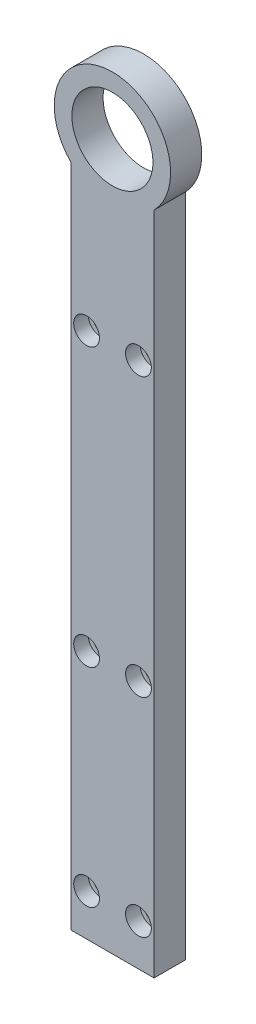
ISO-10303-21;
HEADER;
FILE_DESCRIPTION(('STEP AP214'),'2;1');
FILE_NAME('part.step','',(''),(''),'','','');
FILE_SCHEMA(('AUTOMOTIVE_DESIGN { 1 0 10303 214 1 1 1 1 }'));
ENDSEC;
DATA;
#1=APPLICATION_CONTEXT('core data for automotive mechanical design processes');
#2=APPLICATION_PROTOCOL_DEFINITION('international standard','automotive_design',2000,#1);
#3=PRODUCT_CONTEXT('',#1,'mechanical');
#4=PRODUCT('Part','Part','',(#3));
#5=PRODUCT_RELATED_PRODUCT_CATEGORY('part','',(#4));
#6=PRODUCT_DEFINITION_FORMATION('','',#4);
#7=PRODUCT_DEFINITION_CONTEXT('part definition',#1,'design');
#8=PRODUCT_DEFINITION('design','',#6,#7);
#9=PRODUCT_DEFINITION_SHAPE('','',#8);
#10=(LENGTH_UNIT() NAMED_UNIT(*) SI_UNIT(.MILLI.,.METRE.));
#11=(NAMED_UNIT(*) PLANE_ANGLE_UNIT() SI_UNIT($,.RADIAN.));
#12=(NAMED_UNIT(*) SI_UNIT($,.STERADIAN.) SOLID_ANGLE_UNIT());
#13=UNCERTAINTY_MEASURE_WITH_UNIT(LENGTH_MEASURE(1.E-05),#10,'distance_accuracy_value','');
#14=(GEOMETRIC_REPRESENTATION_CONTEXT(3) GLOBAL_UNCERTAINTY_ASSIGNED_CONTEXT((#13)) GLOBAL_UNIT_ASSIGNED_CONTEXT((#10,
#11,#12)) REPRESENTATION_CONTEXT('',''));
#15=CARTESIAN_POINT('',(0.,0.,0.));
#16=DIRECTION('',(0.,0.,1.));
#17=DIRECTION('',(1.,0.,0.));
#18=AXIS2_PLACEMENT_3D('',#15,#16,#17);
#19=CARTESIAN_POINT('',(-7.89318467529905,-202.911058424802,9.525));
#20=DIRECTION('',(0.,0.,-1.));
#21=DIRECTION('',(-1.,0.,0.));
#22=AXIS2_PLACEMENT_3D('',#19,#20,#21);
#23=CYLINDRICAL_SURFACE('',#22,2.4765);
#24=CARTESIAN_POINT('',(-7.89318467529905,-202.911058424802,0.));
#25=DIRECTION('',(0.,0.,1.));
#26=DIRECTION('',(1.,0.,0.));
#27=AXIS2_PLACEMENT_3D('',#24,#25,#26);
#28=CIRCLE('',#27,2.4765);
#29=CARTESIAN_POINT('',(-10.3696846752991,-202.911058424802,0.));
#30=VERTEX_POINT('',#29);
#31=EDGE_CURVE('E151',#30,#30,#28,.T.);
#32=CARTESIAN_POINT('',(-7.89318467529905,-202.911058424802,5.08));
#33=DIRECTION('',(0.,0.,1.));
#34=DIRECTION('',(1.,0.,0.));
#35=AXIS2_PLACEMENT_3D('',#32,#33,#34);
#36=CIRCLE('',#35,2.4765);
#37=CARTESIAN_POINT('',(-10.3696846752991,-202.911058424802,5.08));
#38=VERTEX_POINT('',#37);
#39=EDGE_CURVE('E37',#38,#38,#36,.T.);
#40=CARTESIAN_POINT('',(-10.3696846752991,-202.911058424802,0.));
#41=CARTESIAN_POINT('',(-10.3696846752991,-202.911058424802,0.0529166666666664));
#42=CARTESIAN_POINT('',(-10.3696846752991,-202.911058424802,0.105833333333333));
#43=CARTESIAN_POINT('',(-10.3696846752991,-202.911058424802,0.211666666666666));
#44=CARTESIAN_POINT('',(-10.3696846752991,-202.911058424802,0.264583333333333));
#45=CARTESIAN_POINT('',(-10.3696846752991,-202.911058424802,0.370416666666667));
#46=CARTESIAN_POINT('',(-10.3696846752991,-202.911058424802,0.423333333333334));
#47=CARTESIAN_POINT('',(-10.3696846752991,-202.911058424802,0.529166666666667));
#48=CARTESIAN_POINT('',(-10.3696846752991,-202.911058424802,0.582083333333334));
#49=CARTESIAN_POINT('',(-10.3696846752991,-202.911058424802,0.687916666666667));
#50=CARTESIAN_POINT('',(-10.3696846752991,-202.911058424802,0.740833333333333));
#51=CARTESIAN_POINT('',(-10.3696846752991,-202.911058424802,0.846666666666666));
#52=CARTESIAN_POINT('',(-10.3696846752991,-202.911058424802,0.899583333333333));
#53=CARTESIAN_POINT('',(-10.3696846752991,-202.911058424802,1.00541666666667));
#54=CARTESIAN_POINT('',(-10.3696846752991,-202.911058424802,1.05833333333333));
#55=CARTESIAN_POINT('',(-10.3696846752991,-202.911058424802,1.16416666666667));
#56=CARTESIAN_POINT('',(-10.3696846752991,-202.911058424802,1.21708333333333));
#57=CARTESIAN_POINT('',(-10.3696846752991,-202.911058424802,1.32291666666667));
#58=CARTESIAN_POINT('',(-10.3696846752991,-202.911058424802,1.37583333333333));
#59=CARTESIAN_POINT('',(-10.3696846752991,-202.911058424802,1.48166666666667));
#60=CARTESIAN_POINT('',(-10.3696846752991,-202.911058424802,1.53458333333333));
#61=CARTESIAN_POINT('',(-10.3696846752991,-202.911058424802,1.64041666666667));
#62=CARTESIAN_POINT('',(-10.3696846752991,-202.911058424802,1.69333333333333));
#63=CARTESIAN_POINT('',(-10.3696846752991,-202.911058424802,1.79916666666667));
#64=CARTESIAN_POINT('',(-10.3696846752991,-202.911058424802,1.85208333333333));
#65=CARTESIAN_POINT('',(-10.3696846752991,-202.911058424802,1.95791666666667));
#66=CARTESIAN_POINT('',(-10.3696846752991,-202.911058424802,2.01083333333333));
#67=CARTESIAN_POINT('',(-10.3696846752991,-202.911058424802,2.11666666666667));
#68=CARTESIAN_POINT('',(-10.3696846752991,-202.911058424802,2.16958333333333));
#69=CARTESIAN_POINT('',(-10.3696846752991,-202.911058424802,2.27541666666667));
#70=CARTESIAN_POINT('',(-10.3696846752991,-202.911058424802,2.32833333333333));
#71=CARTESIAN_POINT('',(-10.3696846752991,-202.911058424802,2.43416666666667));
#72=CARTESIAN_POINT('',(-10.3696846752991,-202.911058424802,2.48708333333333));
#73=CARTESIAN_POINT('',(-10.3696846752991,-202.911058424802,2.59291666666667));
#74=CARTESIAN_POINT('',(-10.3696846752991,-202.911058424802,2.64583333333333));
#75=CARTESIAN_POINT('',(-10.3696846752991,-202.911058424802,2.75166666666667));
#76=CARTESIAN_POINT('',(-10.3696846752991,-202.911058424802,2.80458333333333));
#77=CARTESIAN_POINT('',(-10.3696846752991,-202.911058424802,2.91041666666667));
#78=CARTESIAN_POINT('',(-10.3696846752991,-202.911058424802,2.96333333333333));
#79=CARTESIAN_POINT('',(-10.3696846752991,-202.911058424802,3.06916666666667));
#80=CARTESIAN_POINT('',(-10.3696846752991,-202.911058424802,3.12208333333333));
#81=CARTESIAN_POINT('',(-10.3696846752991,-202.911058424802,3.22791666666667));
#82=CARTESIAN_POINT('',(-10.3696846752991,-202.911058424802,3.28083333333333));
#83=CARTESIAN_POINT('',(-10.3696846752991,-202.911058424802,3.38666666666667));
#84=CARTESIAN_POINT('',(-10.3696846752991,-202.911058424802,3.43958333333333));
#85=CARTESIAN_POINT('',(-10.3696846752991,-202.911058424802,3.54541666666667));
#86=CARTESIAN_POINT('',(-10.3696846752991,-202.911058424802,3.59833333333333));
#87=CARTESIAN_POINT('',(-10.3696846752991,-202.911058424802,3.70416666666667));
#88=CARTESIAN_POINT('',(-10.3696846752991,-202.911058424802,3.75708333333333));
#89=CARTESIAN_POINT('',(-10.3696846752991,-202.911058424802,3.86291666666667));
#90=CARTESIAN_POINT('',(-10.3696846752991,-202.911058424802,3.91583333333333));
#91=CARTESIAN_POINT('',(-10.3696846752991,-202.911058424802,4.02166666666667));
#92=CARTESIAN_POINT('',(-10.3696846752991,-202.911058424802,4.07458333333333));
#93=CARTESIAN_POINT('',(-10.3696846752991,-202.911058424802,4.18041666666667));
#94=CARTESIAN_POINT('',(-10.3696846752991,-202.911058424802,4.23333333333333));
#95=CARTESIAN_POINT('',(-10.3696846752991,-202.911058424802,4.33916666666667));
#96=CARTESIAN_POINT('',(-10.3696846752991,-202.911058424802,4.39208333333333));
#97=CARTESIAN_POINT('',(-10.3696846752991,-202.911058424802,4.49791666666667));
#98=CARTESIAN_POINT('',(-10.3696846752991,-202.911058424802,4.55083333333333));
#99=CARTESIAN_POINT('',(-10.3696846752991,-202.911058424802,4.65666666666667));
#100=CARTESIAN_POINT('',(-10.3696846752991,-202.911058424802,4.70958333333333));
#101=CARTESIAN_POINT('',(-10.3696846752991,-202.911058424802,4.81541666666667));
#102=CARTESIAN_POINT('',(-10.3696846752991,-202.911058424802,4.86833333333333));
#103=CARTESIAN_POINT('',(-10.3696846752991,-202.911058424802,4.97416666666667));
#104=CARTESIAN_POINT('',(-10.3696846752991,-202.911058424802,5.02708333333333));
#105=CARTESIAN_POINT('',(-10.3696846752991,-202.911058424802,5.08));
#106=B_SPLINE_CURVE_WITH_KNOTS('',3,(#40,#41,#42,#43,#44,#45,#46,#47,#48,#49,#50,#51,#52,#53,
#54,#55,#56,#57,#58,#59,#60,#61,#62,#63,#64,#65,#66,#67,#68,#69,#70,#71,#72,#73,#74,#75,#76,#77,
#78,#79,#80,#81,#82,#83,#84,#85,#86,#87,#88,#89,#90,#91,#92,#93,#94,#95,#96,#97,#98,#99,#100,
#101,#102,#103,#104,#105),.UNSPECIFIED.,.F.,.F.,(4,2,2,2,2,2,2,2,2,2,2,2,2,2,2,2,2,2,2,2,2,2,2,
2,2,2,2,2,2,2,2,2,4),(0.,0.158749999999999,0.3175,0.476250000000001,0.635,0.793749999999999,
0.9525,1.11125,1.27,1.42875,1.5875,1.74625,1.905,2.06375,2.2225,2.38125,2.54,2.69875,2.8575,
3.01625,3.175,3.33375,3.4925,3.65125,3.81,3.96875,4.1275,4.28625,4.445,4.60375,4.7625,4.92125,
5.08),.UNSPECIFIED.);
#107=EDGE_CURVE('BSEAM33',#30,#38,#106,.T.);
#108=ORIENTED_EDGE('',*,*,#31,.F.);
#109=ORIENTED_EDGE('',*,*,#39,.T.);
#110=ORIENTED_EDGE('',*,*,#107,.T.);
#111=ORIENTED_EDGE('',*,*,#107,.F.);
#112=EDGE_LOOP('',(#108,#110,#109,#111));
#113=FACE_BOUND('',#112,.T.);
#114=ADVANCED_FACE('F33',(#113),#23,.F.);
#115=CARTESIAN_POINT('',(7.95641532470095,-202.911058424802,9.525));
#116=DIRECTION('',(0.,0.,-1.));
#117=DIRECTION('',(-1.,0.,0.));
#118=AXIS2_PLACEMENT_3D('',#115,#116,#117);
#119=CYLINDRICAL_SURFACE('',#118,2.4765);
#120=CARTESIAN_POINT('',(7.95641532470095,-202.911058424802,0.));
#121=DIRECTION('',(0.,0.,1.));
#122=DIRECTION('',(1.,0.,0.));
#123=AXIS2_PLACEMENT_3D('',#120,#121,#122);
#124=CIRCLE('',#123,2.4765);
#125=CARTESIAN_POINT('',(5.47991532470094,-202.911058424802,0.));
#126=VERTEX_POINT('',#125);
#127=EDGE_CURVE('E148',#126,#126,#124,.T.);
#128=CARTESIAN_POINT('',(7.95641532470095,-202.911058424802,5.08));
#129=DIRECTION('',(0.,0.,1.));
#130=DIRECTION('',(1.,0.,0.));
#131=AXIS2_PLACEMENT_3D('',#128,#129,#130);
#132=CIRCLE('',#131,2.4765);
#133=CARTESIAN_POINT('',(5.47991532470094,-202.911058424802,5.08));
#134=VERTEX_POINT('',#133);
#135=EDGE_CURVE('E124',#134,#134,#132,.T.);
#136=CARTESIAN_POINT('',(5.47991532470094,-202.911058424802,0.));
#137=CARTESIAN_POINT('',(5.47991532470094,-202.911058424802,0.0529166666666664));
#138=CARTESIAN_POINT('',(5.47991532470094,-202.911058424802,0.105833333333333));
#139=CARTESIAN_POINT('',(5.47991532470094,-202.911058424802,0.211666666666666));
#140=CARTESIAN_POINT('',(5.47991532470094,-202.911058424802,0.264583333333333));
#141=CARTESIAN_POINT('',(5.47991532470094,-202.911058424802,0.370416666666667));
#142=CARTESIAN_POINT('',(5.47991532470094,-202.911058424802,0.423333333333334));
#143=CARTESIAN_POINT('',(5.47991532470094,-202.911058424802,0.529166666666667));
#144=CARTESIAN_POINT('',(5.47991532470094,-202.911058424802,0.582083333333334));
#145=CARTESIAN_POINT('',(5.47991532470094,-202.911058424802,0.687916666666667));
#146=CARTESIAN_POINT('',(5.47991532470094,-202.911058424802,0.740833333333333));
#147=CARTESIAN_POINT('',(5.47991532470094,-202.911058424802,0.846666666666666));
#148=CARTESIAN_POINT('',(5.47991532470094,-202.911058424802,0.899583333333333));
#149=CARTESIAN_POINT('',(5.47991532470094,-202.911058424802,1.00541666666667));
#150=CARTESIAN_POINT('',(5.47991532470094,-202.911058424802,1.05833333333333));
#151=CARTESIAN_POINT('',(5.47991532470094,-202.911058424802,1.16416666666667));
#152=CARTESIAN_POINT('',(5.47991532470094,-202.911058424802,1.21708333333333));
#153=CARTESIAN_POINT('',(5.47991532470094,-202.911058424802,1.32291666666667));
#154=CARTESIAN_POINT('',(5.47991532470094,-202.911058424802,1.37583333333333));
#155=CARTESIAN_POINT('',(5.47991532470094,-202.911058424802,1.48166666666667));
#156=CARTESIAN_POINT('',(5.47991532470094,-202.911058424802,1.53458333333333));
#157=CARTESIAN_POINT('',(5.47991532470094,-202.911058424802,1.64041666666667));
#158=CARTESIAN_POINT('',(5.47991532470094,-202.911058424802,1.69333333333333));
#159=CARTESIAN_POINT('',(5.47991532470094,-202.911058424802,1.79916666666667));
#160=CARTESIAN_POINT('',(5.47991532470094,-202.911058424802,1.85208333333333));
#161=CARTESIAN_POINT('',(5.47991532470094,-202.911058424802,1.95791666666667));
#162=CARTESIAN_POINT('',(5.47991532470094,-202.911058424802,2.01083333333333));
#163=CARTESIAN_POINT('',(5.47991532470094,-202.911058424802,2.11666666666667));
#164=CARTESIAN_POINT('',(5.47991532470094,-202.911058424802,2.16958333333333));
#165=CARTESIAN_POINT('',(5.47991532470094,-202.911058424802,2.27541666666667));
#166=CARTESIAN_POINT('',(5.47991532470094,-202.911058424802,2.32833333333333));
#167=CARTESIAN_POINT('',(5.47991532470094,-202.911058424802,2.43416666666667));
#168=CARTESIAN_POINT('',(5.47991532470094,-202.911058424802,2.48708333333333));
#169=CARTESIAN_POINT('',(5.47991532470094,-202.911058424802,2.59291666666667));
#170=CARTESIAN_POINT('',(5.47991532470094,-202.911058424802,2.64583333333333));
#171=CARTESIAN_POINT('',(5.47991532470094,-202.911058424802,2.75166666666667));
#172=CARTESIAN_POINT('',(5.47991532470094,-202.911058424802,2.80458333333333));
#173=CARTESIAN_POINT('',(5.47991532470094,-202.911058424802,2.91041666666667));
#174=CARTESIAN_POINT('',(5.47991532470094,-202.911058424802,2.96333333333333));
#175=CARTESIAN_POINT('',(5.47991532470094,-202.911058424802,3.06916666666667));
#176=CARTESIAN_POINT('',(5.47991532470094,-202.911058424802,3.12208333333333));
#177=CARTESIAN_POINT('',(5.47991532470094,-202.911058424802,3.22791666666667));
#178=CARTESIAN_POINT('',(5.47991532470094,-202.911058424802,3.28083333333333));
#179=CARTESIAN_POINT('',(5.47991532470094,-202.911058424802,3.38666666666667));
#180=CARTESIAN_POINT('',(5.47991532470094,-202.911058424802,3.43958333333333));
#181=CARTESIAN_POINT('',(5.47991532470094,-202.911058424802,3.54541666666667));
#182=CARTESIAN_POINT('',(5.47991532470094,-202.911058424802,3.59833333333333));
#183=CARTESIAN_POINT('',(5.47991532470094,-202.911058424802,3.70416666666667));
#184=CARTESIAN_POINT('',(5.47991532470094,-202.911058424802,3.75708333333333));
#185=CARTESIAN_POINT('',(5.47991532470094,-202.911058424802,3.86291666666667));
#186=CARTESIAN_POINT('',(5.47991532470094,-202.911058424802,3.91583333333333));
#187=CARTESIAN_POINT('',(5.47991532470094,-202.911058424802,4.02166666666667));
#188=CARTESIAN_POINT('',(5.47991532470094,-202.911058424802,4.07458333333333));
#189=CARTESIAN_POINT('',(5.47991532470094,-202.911058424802,4.18041666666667));
#190=CARTESIAN_POINT('',(5.47991532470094,-202.911058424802,4.23333333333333));
#191=CARTESIAN_POINT('',(5.47991532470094,-202.911058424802,4.33916666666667));
#192=CARTESIAN_POINT('',(5.47991532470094,-202.911058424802,4.39208333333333));
#193=CARTESIAN_POINT('',(5.47991532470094,-202.911058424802,4.49791666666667));
#194=CARTESIAN_POINT('',(5.47991532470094,-202.911058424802,4.55083333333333));
#195=CARTESIAN_POINT('',(5.47991532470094,-202.911058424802,4.65666666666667));
#196=CARTESIAN_POINT('',(5.47991532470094,-202.911058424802,4.70958333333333));
#197=CARTESIAN_POINT('',(5.47991532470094,-202.911058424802,4.81541666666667));
#198=CARTESIAN_POINT('',(5.47991532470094,-202.911058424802,4.86833333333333));
#199=CARTESIAN_POINT('',(5.47991532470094,-202.911058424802,4.97416666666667));
#200=CARTESIAN_POINT('',(5.47991532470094,-202.911058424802,5.02708333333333));
#201=CARTESIAN_POINT('',(5.47991532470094,-202.911058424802,5.08));
#202=B_SPLINE_CURVE_WITH_KNOTS('',3,(#136,#137,#138,#139,#140,#141,#142,#143,#144,#145,#146,
#147,#148,#149,#150,#151,#152,#153,#154,#155,#156,#157,#158,#159,#160,#161,#162,#163,#164,#165,
#166,#167,#168,#169,#170,#171,#172,#173,#174,#175,#176,#177,#178,#179,#180,#181,#182,#183,#184,
#185,#186,#187,#188,#189,#190,#191,#192,#193,#194,#195,#196,#197,#198,#199,#200,#201),
.UNSPECIFIED.,.F.,.F.,(4,2,2,2,2,2,2,2,2,2,2,2,2,2,2,2,2,2,2,2,2,2,2,2,2,2,2,2,2,2,2,2,4),(0.,
0.158749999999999,0.3175,0.476250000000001,0.635,0.793749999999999,0.9525,1.11125,1.27,1.42875,
1.5875,1.74625,1.905,2.06375,2.2225,2.38125,2.54,2.69875,2.8575,3.01625,3.175,3.33375,3.4925,
3.65125,3.81,3.96875,4.1275,4.28625,4.445,4.60375,4.7625,4.92125,5.08),.UNSPECIFIED.);
#203=EDGE_CURVE('BSEAM183',#126,#134,#202,.T.);
#204=ORIENTED_EDGE('',*,*,#127,.F.);
#205=ORIENTED_EDGE('',*,*,#135,.T.);
#206=ORIENTED_EDGE('',*,*,#203,.T.);
#207=ORIENTED_EDGE('',*,*,#203,.F.);
#208=EDGE_LOOP('',(#204,#206,#205,#207));
#209=FACE_BOUND('',#208,.T.);
#210=ADVANCED_FACE('F183',(#209),#119,.F.);
#211=CARTESIAN_POINT('',(7.95641532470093,-54.5496584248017,9.525));
#212=DIRECTION('',(0.,0.,-1.));
#213=DIRECTION('',(-1.,0.,0.));
#214=AXIS2_PLACEMENT_3D('',#211,#212,#213);
#215=CYLINDRICAL_SURFACE('',#214,2.4765);
#216=CARTESIAN_POINT('',(7.95641532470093,-54.5496584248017,0.));
#217=DIRECTION('',(0.,0.,1.));
#218=DIRECTION('',(1.,0.,0.));
#219=AXIS2_PLACEMENT_3D('',#216,#217,#218);
#220=CIRCLE('',#219,2.4765);
#221=CARTESIAN_POINT('',(5.47991532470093,-54.5496584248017,0.));
#222=VERTEX_POINT('',#221);
#223=EDGE_CURVE('E145',#222,#222,#220,.T.);
#224=CARTESIAN_POINT('',(7.95641532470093,-54.5496584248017,5.08));
#225=DIRECTION('',(0.,0.,1.));
#226=DIRECTION('',(1.,0.,0.));
#227=AXIS2_PLACEMENT_3D('',#224,#225,#226);
#228=CIRCLE('',#227,2.4765);
#229=CARTESIAN_POINT('',(5.47991532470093,-54.5496584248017,5.08));
#230=VERTEX_POINT('',#229);
#231=EDGE_CURVE('E122',#230,#230,#228,.T.);
#232=CARTESIAN_POINT('',(5.47991532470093,-54.5496584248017,0.));
#233=CARTESIAN_POINT('',(5.47991532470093,-54.5496584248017,0.0529166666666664));
#234=CARTESIAN_POINT('',(5.47991532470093,-54.5496584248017,0.105833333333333));
#235=CARTESIAN_POINT('',(5.47991532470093,-54.5496584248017,0.211666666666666));
#236=CARTESIAN_POINT('',(5.47991532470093,-54.5496584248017,0.264583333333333));
#237=CARTESIAN_POINT('',(5.47991532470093,-54.5496584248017,0.370416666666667));
#238=CARTESIAN_POINT('',(5.47991532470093,-54.5496584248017,0.423333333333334));
#239=CARTESIAN_POINT('',(5.47991532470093,-54.5496584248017,0.529166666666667));
#240=CARTESIAN_POINT('',(5.47991532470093,-54.5496584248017,0.582083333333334));
#241=CARTESIAN_POINT('',(5.47991532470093,-54.5496584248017,0.687916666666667));
#242=CARTESIAN_POINT('',(5.47991532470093,-54.5496584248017,0.740833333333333));
#243=CARTESIAN_POINT('',(5.47991532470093,-54.5496584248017,0.846666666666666));
#244=CARTESIAN_POINT('',(5.47991532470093,-54.5496584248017,0.899583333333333));
#245=CARTESIAN_POINT('',(5.47991532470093,-54.5496584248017,1.00541666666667));
#246=CARTESIAN_POINT('',(5.47991532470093,-54.5496584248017,1.05833333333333));
#247=CARTESIAN_POINT('',(5.47991532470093,-54.5496584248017,1.16416666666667));
#248=CARTESIAN_POINT('',(5.47991532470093,-54.5496584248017,1.21708333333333));
#249=CARTESIAN_POINT('',(5.47991532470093,-54.5496584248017,1.32291666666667));
#250=CARTESIAN_POINT('',(5.47991532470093,-54.5496584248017,1.37583333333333));
#251=CARTESIAN_POINT('',(5.47991532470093,-54.5496584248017,1.48166666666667));
#252=CARTESIAN_POINT('',(5.47991532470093,-54.5496584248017,1.53458333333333));
#253=CARTESIAN_POINT('',(5.47991532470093,-54.5496584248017,1.64041666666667));
#254=CARTESIAN_POINT('',(5.47991532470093,-54.5496584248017,1.69333333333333));
#255=CARTESIAN_POINT('',(5.47991532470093,-54.5496584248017,1.79916666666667));
#256=CARTESIAN_POINT('',(5.47991532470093,-54.5496584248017,1.85208333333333));
#257=CARTESIAN_POINT('',(5.47991532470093,-54.5496584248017,1.95791666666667));
#258=CARTESIAN_POINT('',(5.47991532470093,-54.5496584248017,2.01083333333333));
#259=CARTESIAN_POINT('',(5.47991532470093,-54.5496584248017,2.11666666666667));
#260=CARTESIAN_POINT('',(5.47991532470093,-54.5496584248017,2.16958333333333));
#261=CARTESIAN_POINT('',(5.47991532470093,-54.5496584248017,2.27541666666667));
#262=CARTESIAN_POINT('',(5.47991532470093,-54.5496584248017,2.32833333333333));
#263=CARTESIAN_POINT('',(5.47991532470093,-54.5496584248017,2.43416666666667));
#264=CARTESIAN_POINT('',(5.47991532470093,-54.5496584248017,2.48708333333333));
#265=CARTESIAN_POINT('',(5.47991532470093,-54.5496584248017,2.59291666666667));
#266=CARTESIAN_POINT('',(5.47991532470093,-54.5496584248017,2.64583333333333));
#267=CARTESIAN_POINT('',(5.47991532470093,-54.5496584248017,2.75166666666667));
#268=CARTESIAN_POINT('',(5.47991532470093,-54.5496584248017,2.80458333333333));
#269=CARTESIAN_POINT('',(5.47991532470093,-54.5496584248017,2.91041666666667));
#270=CARTESIAN_POINT('',(5.47991532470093,-54.5496584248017,2.96333333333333));
#271=CARTESIAN_POINT('',(5.47991532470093,-54.5496584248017,3.06916666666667));
#272=CARTESIAN_POINT('',(5.47991532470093,-54.5496584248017,3.12208333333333));
#273=CARTESIAN_POINT('',(5.47991532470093,-54.5496584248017,3.22791666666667));
#274=CARTESIAN_POINT('',(5.47991532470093,-54.5496584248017,3.28083333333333));
#275=CARTESIAN_POINT('',(5.47991532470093,-54.5496584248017,3.38666666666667));
#276=CARTESIAN_POINT('',(5.47991532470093,-54.5496584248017,3.43958333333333));
#277=CARTESIAN_POINT('',(5.47991532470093,-54.5496584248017,3.54541666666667));
#278=CARTESIAN_POINT('',(5.47991532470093,-54.5496584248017,3.59833333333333));
#279=CARTESIAN_POINT('',(5.47991532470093,-54.5496584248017,3.70416666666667));
#280=CARTESIAN_POINT('',(5.47991532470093,-54.5496584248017,3.75708333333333));
#281=CARTESIAN_POINT('',(5.47991532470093,-54.5496584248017,3.86291666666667));
#282=CARTESIAN_POINT('',(5.47991532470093,-54.5496584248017,3.91583333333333));
#283=CARTESIAN_POINT('',(5.47991532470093,-54.5496584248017,4.02166666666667));
#284=CARTESIAN_POINT('',(5.47991532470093,-54.5496584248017,4.07458333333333));
#285=CARTESIAN_POINT('',(5.47991532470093,-54.5496584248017,4.18041666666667));
#286=CARTESIAN_POINT('',(5.47991532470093,-54.5496584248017,4.23333333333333));
#287=CARTESIAN_POINT('',(5.47991532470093,-54.5496584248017,4.33916666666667));
#288=CARTESIAN_POINT('',(5.47991532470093,-54.5496584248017,4.39208333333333));
#289=CARTESIAN_POINT('',(5.47991532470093,-54.5496584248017,4.49791666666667));
#290=CARTESIAN_POINT('',(5.47991532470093,-54.5496584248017,4.55083333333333));
#291=CARTESIAN_POINT('',(5.47991532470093,-54.5496584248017,4.65666666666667));
#292=CARTESIAN_POINT('',(5.47991532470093,-54.5496584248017,4.70958333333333));
#293=CARTESIAN_POINT('',(5.47991532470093,-54.5496584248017,4.81541666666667));
#294=CARTESIAN_POINT('',(5.47991532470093,-54.5496584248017,4.86833333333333));
#295=CARTESIAN_POINT('',(5.47991532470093,-54.5496584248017,4.97416666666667));
#296=CARTESIAN_POINT('',(5.47991532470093,-54.5496584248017,5.02708333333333));
#297=CARTESIAN_POINT('',(5.47991532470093,-54.5496584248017,5.08));
#298=B_SPLINE_CURVE_WITH_KNOTS('',3,(#232,#233,#234,#235,#236,#237,#238,#239,#240,#241,#242,
#243,#244,#245,#246,#247,#248,#249,#250,#251,#252,#253,#254,#255,#256,#257,#258,#259,#260,#261,
#262,#263,#264,#265,#266,#267,#268,#269,#270,#271,#272,#273,#274,#275,#276,#277,#278,#279,#280,
#281,#282,#283,#284,#285,#286,#287,#288,#289,#290,#291,#292,#293,#294,#295,#296,#297),
.UNSPECIFIED.,.F.,.F.,(4,2,2,2,2,2,2,2,2,2,2,2,2,2,2,2,2,2,2,2,2,2,2,2,2,2,2,2,2,2,2,2,4),(0.,
0.158749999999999,0.3175,0.476250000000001,0.635,0.793749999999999,0.9525,1.11125,1.27,1.42875,
1.5875,1.74625,1.905,2.06375,2.2225,2.38125,2.54,2.69875,2.8575,3.01625,3.175,3.33375,3.4925,
3.65125,3.81,3.96875,4.1275,4.28625,4.445,4.60375,4.7625,4.92125,5.08),.UNSPECIFIED.);
#299=EDGE_CURVE('BSEAM189',#222,#230,#298,.T.);
#300=ORIENTED_EDGE('',*,*,#223,.F.);
#301=ORIENTED_EDGE('',*,*,#231,.T.);
#302=ORIENTED_EDGE('',*,*,#299,.T.);
#303=ORIENTED_EDGE('',*,*,#299,.F.);
#304=EDGE_LOOP('',(#300,#302,#301,#303));
#305=FACE_BOUND('',#304,.T.);
#306=ADVANCED_FACE('F189',(#305),#215,.F.);
#307=CARTESIAN_POINT('',(-7.89318467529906,-139.411058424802,9.525));
#308=DIRECTION('',(0.,0.,-1.));
#309=DIRECTION('',(-1.,0.,0.));
#310=AXIS2_PLACEMENT_3D('',#307,#308,#309);
#311=CYLINDRICAL_SURFACE('',#310,2.47650000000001);
#312=CARTESIAN_POINT('',(-7.89318467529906,-139.411058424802,0.));
#313=DIRECTION('',(0.,0.,1.));
#314=DIRECTION('',(1.,0.,0.));
#315=AXIS2_PLACEMENT_3D('',#312,#313,#314);
#316=CIRCLE('',#315,2.47650000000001);
#317=CARTESIAN_POINT('',(-10.3696846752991,-139.411058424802,0.));
#318=VERTEX_POINT('',#317);
#319=EDGE_CURVE('E142',#318,#318,#316,.T.);
#320=CARTESIAN_POINT('',(-7.89318467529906,-139.411058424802,5.08));
#321=DIRECTION('',(0.,0.,1.));
#322=DIRECTION('',(1.,0.,0.));
#323=AXIS2_PLACEMENT_3D('',#320,#321,#322);
#324=CIRCLE('',#323,2.47650000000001);
#325=CARTESIAN_POINT('',(-10.3696846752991,-139.411058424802,5.08));
#326=VERTEX_POINT('',#325);
#327=EDGE_CURVE('E118',#326,#326,#324,.T.);
#328=CARTESIAN_POINT('',(-10.3696846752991,-139.411058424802,0.));
#329=CARTESIAN_POINT('',(-10.3696846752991,-139.411058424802,0.0529166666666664));
#330=CARTESIAN_POINT('',(-10.3696846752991,-139.411058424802,0.105833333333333));
#331=CARTESIAN_POINT('',(-10.3696846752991,-139.411058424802,0.211666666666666));
#332=CARTESIAN_POINT('',(-10.3696846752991,-139.411058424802,0.264583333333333));
#333=CARTESIAN_POINT('',(-10.3696846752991,-139.411058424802,0.370416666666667));
#334=CARTESIAN_POINT('',(-10.3696846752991,-139.411058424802,0.423333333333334));
#335=CARTESIAN_POINT('',(-10.3696846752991,-139.411058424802,0.529166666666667));
#336=CARTESIAN_POINT('',(-10.3696846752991,-139.411058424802,0.582083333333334));
#337=CARTESIAN_POINT('',(-10.3696846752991,-139.411058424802,0.687916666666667));
#338=CARTESIAN_POINT('',(-10.3696846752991,-139.411058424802,0.740833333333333));
#339=CARTESIAN_POINT('',(-10.3696846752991,-139.411058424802,0.846666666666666));
#340=CARTESIAN_POINT('',(-10.3696846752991,-139.411058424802,0.899583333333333));
#341=CARTESIAN_POINT('',(-10.3696846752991,-139.411058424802,1.00541666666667));
#342=CARTESIAN_POINT('',(-10.3696846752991,-139.411058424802,1.05833333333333));
#343=CARTESIAN_POINT('',(-10.3696846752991,-139.411058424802,1.16416666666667));
#344=CARTESIAN_POINT('',(-10.3696846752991,-139.411058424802,1.21708333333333));
#345=CARTESIAN_POINT('',(-10.3696846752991,-139.411058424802,1.32291666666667));
#346=CARTESIAN_POINT('',(-10.3696846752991,-139.411058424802,1.37583333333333));
#347=CARTESIAN_POINT('',(-10.3696846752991,-139.411058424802,1.48166666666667));
#348=CARTESIAN_POINT('',(-10.3696846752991,-139.411058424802,1.53458333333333));
#349=CARTESIAN_POINT('',(-10.3696846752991,-139.411058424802,1.64041666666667));
#350=CARTESIAN_POINT('',(-10.3696846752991,-139.411058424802,1.69333333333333));
#351=CARTESIAN_POINT('',(-10.3696846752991,-139.411058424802,1.79916666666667));
#352=CARTESIAN_POINT('',(-10.3696846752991,-139.411058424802,1.85208333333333));
#353=CARTESIAN_POINT('',(-10.3696846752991,-139.411058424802,1.95791666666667));
#354=CARTESIAN_POINT('',(-10.3696846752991,-139.411058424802,2.01083333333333));
#355=CARTESIAN_POINT('',(-10.3696846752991,-139.411058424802,2.11666666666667));
#356=CARTESIAN_POINT('',(-10.3696846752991,-139.411058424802,2.16958333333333));
#357=CARTESIAN_POINT('',(-10.3696846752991,-139.411058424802,2.27541666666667));
#358=CARTESIAN_POINT('',(-10.3696846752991,-139.411058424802,2.32833333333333));
#359=CARTESIAN_POINT('',(-10.3696846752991,-139.411058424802,2.43416666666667));
#360=CARTESIAN_POINT('',(-10.3696846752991,-139.411058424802,2.48708333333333));
#361=CARTESIAN_POINT('',(-10.3696846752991,-139.411058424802,2.59291666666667));
#362=CARTESIAN_POINT('',(-10.3696846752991,-139.411058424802,2.64583333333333));
#363=CARTESIAN_POINT('',(-10.3696846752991,-139.411058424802,2.75166666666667));
#364=CARTESIAN_POINT('',(-10.3696846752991,-139.411058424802,2.80458333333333));
#365=CARTESIAN_POINT('',(-10.3696846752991,-139.411058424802,2.91041666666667));
#366=CARTESIAN_POINT('',(-10.3696846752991,-139.411058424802,2.96333333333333));
#367=CARTESIAN_POINT('',(-10.3696846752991,-139.411058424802,3.06916666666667));
#368=CARTESIAN_POINT('',(-10.3696846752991,-139.411058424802,3.12208333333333));
#369=CARTESIAN_POINT('',(-10.3696846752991,-139.411058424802,3.22791666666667));
#370=CARTESIAN_POINT('',(-10.3696846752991,-139.411058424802,3.28083333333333));
#371=CARTESIAN_POINT('',(-10.3696846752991,-139.411058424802,3.38666666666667));
#372=CARTESIAN_POINT('',(-10.3696846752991,-139.411058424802,3.43958333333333));
#373=CARTESIAN_POINT('',(-10.3696846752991,-139.411058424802,3.54541666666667));
#374=CARTESIAN_POINT('',(-10.3696846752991,-139.411058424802,3.59833333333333));
#375=CARTESIAN_POINT('',(-10.3696846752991,-139.411058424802,3.70416666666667));
#376=CARTESIAN_POINT('',(-10.3696846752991,-139.411058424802,3.75708333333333));
#377=CARTESIAN_POINT('',(-10.3696846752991,-139.411058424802,3.86291666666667));
#378=CARTESIAN_POINT('',(-10.3696846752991,-139.411058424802,3.91583333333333));
#379=CARTESIAN_POINT('',(-10.3696846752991,-139.411058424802,4.02166666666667));
#380=CARTESIAN_POINT('',(-10.3696846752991,-139.411058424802,4.07458333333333));
#381=CARTESIAN_POINT('',(-10.3696846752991,-139.411058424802,4.18041666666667));
#382=CARTESIAN_POINT('',(-10.3696846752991,-139.411058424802,4.23333333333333));
#383=CARTESIAN_POINT('',(-10.3696846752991,-139.411058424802,4.33916666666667));
#384=CARTESIAN_POINT('',(-10.3696846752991,-139.411058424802,4.39208333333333));
#385=CARTESIAN_POINT('',(-10.3696846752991,-139.411058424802,4.49791666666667));
#386=CARTESIAN_POINT('',(-10.3696846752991,-139.411058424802,4.55083333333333));
#387=CARTESIAN_POINT('',(-10.3696846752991,-139.411058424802,4.65666666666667));
#388=CARTESIAN_POINT('',(-10.3696846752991,-139.411058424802,4.70958333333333));
#389=CARTESIAN_POINT('',(-10.3696846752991,-139.411058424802,4.81541666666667));
#390=CARTESIAN_POINT('',(-10.3696846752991,-139.411058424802,4.86833333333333));
#391=CARTESIAN_POINT('',(-10.3696846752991,-139.411058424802,4.97416666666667));
#392=CARTESIAN_POINT('',(-10.3696846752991,-139.411058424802,5.02708333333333));
#393=CARTESIAN_POINT('',(-10.3696846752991,-139.411058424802,5.08));
#394=B_SPLINE_CURVE_WITH_KNOTS('',3,(#328,#329,#330,#331,#332,#333,#334,#335,#336,#337,#338,
#339,#340,#341,#342,#343,#344,#345,#346,#347,#348,#349,#350,#351,#352,#353,#354,#355,#356,#357,
#358,#359,#360,#361,#362,#363,#364,#365,#366,#367,#368,#369,#370,#371,#372,#373,#374,#375,#376,
#377,#378,#379,#380,#381,#382,#383,#384,#385,#386,#387,#388,#389,#390,#391,#392,#393),
.UNSPECIFIED.,.F.,.F.,(4,2,2,2,2,2,2,2,2,2,2,2,2,2,2,2,2,2,2,2,2,2,2,2,2,2,2,2,2,2,2,2,4),(0.,
0.158749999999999,0.3175,0.476250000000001,0.635,0.793749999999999,0.9525,1.11125,1.27,1.42875,
1.5875,1.74625,1.905,2.06375,2.2225,2.38125,2.54,2.69875,2.8575,3.01625,3.175,3.33375,3.4925,
3.65125,3.81,3.96875,4.1275,4.28625,4.445,4.60375,4.7625,4.92125,5.08),.UNSPECIFIED.);
#395=EDGE_CURVE('BSEAM203',#318,#326,#394,.T.);
#396=ORIENTED_EDGE('',*,*,#319,.F.);
#397=ORIENTED_EDGE('',*,*,#327,.T.);
#398=ORIENTED_EDGE('',*,*,#395,.T.);
#399=ORIENTED_EDGE('',*,*,#395,.F.);
#400=EDGE_LOOP('',(#396,#398,#397,#399));
#401=FACE_BOUND('',#400,.T.);
#402=ADVANCED_FACE('F203',(#401),#311,.F.);
#403=CARTESIAN_POINT('',(7.96911532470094,-139.411058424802,9.525));
#404=DIRECTION('',(0.,0.,-1.));
#405=DIRECTION('',(-1.,0.,0.));
#406=AXIS2_PLACEMENT_3D('',#403,#404,#405);
#407=CYLINDRICAL_SURFACE('',#406,2.47650000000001);
#408=CARTESIAN_POINT('',(7.96911532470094,-139.411058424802,0.));
#409=DIRECTION('',(0.,0.,1.));
#410=DIRECTION('',(1.,0.,0.));
#411=AXIS2_PLACEMENT_3D('',#408,#409,#410);
#412=CIRCLE('',#411,2.47650000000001);
#413=CARTESIAN_POINT('',(5.49261532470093,-139.411058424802,0.));
#414=VERTEX_POINT('',#413);
#415=EDGE_CURVE('E113',#414,#414,#412,.T.);
#416=CARTESIAN_POINT('',(7.96911532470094,-139.411058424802,5.08));
#417=DIRECTION('',(0.,0.,1.));
#418=DIRECTION('',(1.,0.,0.));
#419=AXIS2_PLACEMENT_3D('',#416,#417,#418);
#420=CIRCLE('',#419,2.47650000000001);
#421=CARTESIAN_POINT('',(5.49261532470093,-139.411058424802,5.08));
#422=VERTEX_POINT('',#421);
#423=EDGE_CURVE('E115',#422,#422,#420,.T.);
#424=CARTESIAN_POINT('',(5.49261532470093,-139.411058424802,0.));
#425=CARTESIAN_POINT('',(5.49261532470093,-139.411058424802,0.0529166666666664));
#426=CARTESIAN_POINT('',(5.49261532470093,-139.411058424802,0.105833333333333));
#427=CARTESIAN_POINT('',(5.49261532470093,-139.411058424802,0.211666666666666));
#428=CARTESIAN_POINT('',(5.49261532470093,-139.411058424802,0.264583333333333));
#429=CARTESIAN_POINT('',(5.49261532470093,-139.411058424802,0.370416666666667));
#430=CARTESIAN_POINT('',(5.49261532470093,-139.411058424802,0.423333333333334));
#431=CARTESIAN_POINT('',(5.49261532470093,-139.411058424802,0.529166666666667));
#432=CARTESIAN_POINT('',(5.49261532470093,-139.411058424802,0.582083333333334));
#433=CARTESIAN_POINT('',(5.49261532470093,-139.411058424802,0.687916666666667));
#434=CARTESIAN_POINT('',(5.49261532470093,-139.411058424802,0.740833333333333));
#435=CARTESIAN_POINT('',(5.49261532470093,-139.411058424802,0.846666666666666));
#436=CARTESIAN_POINT('',(5.49261532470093,-139.411058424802,0.899583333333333));
#437=CARTESIAN_POINT('',(5.49261532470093,-139.411058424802,1.00541666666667));
#438=CARTESIAN_POINT('',(5.49261532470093,-139.411058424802,1.05833333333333));
#439=CARTESIAN_POINT('',(5.49261532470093,-139.411058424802,1.16416666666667));
#440=CARTESIAN_POINT('',(5.49261532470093,-139.411058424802,1.21708333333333));
#441=CARTESIAN_POINT('',(5.49261532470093,-139.411058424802,1.32291666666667));
#442=CARTESIAN_POINT('',(5.49261532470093,-139.411058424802,1.37583333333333));
#443=CARTESIAN_POINT('',(5.49261532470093,-139.411058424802,1.48166666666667));
#444=CARTESIAN_POINT('',(5.49261532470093,-139.411058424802,1.53458333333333));
#445=CARTESIAN_POINT('',(5.49261532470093,-139.411058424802,1.64041666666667));
#446=CARTESIAN_POINT('',(5.49261532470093,-139.411058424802,1.69333333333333));
#447=CARTESIAN_POINT('',(5.49261532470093,-139.411058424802,1.79916666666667));
#448=CARTESIAN_POINT('',(5.49261532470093,-139.411058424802,1.85208333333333));
#449=CARTESIAN_POINT('',(5.49261532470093,-139.411058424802,1.95791666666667));
#450=CARTESIAN_POINT('',(5.49261532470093,-139.411058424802,2.01083333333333));
#451=CARTESIAN_POINT('',(5.49261532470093,-139.411058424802,2.11666666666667));
#452=CARTESIAN_POINT('',(5.49261532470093,-139.411058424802,2.16958333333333));
#453=CARTESIAN_POINT('',(5.49261532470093,-139.411058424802,2.27541666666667));
#454=CARTESIAN_POINT('',(5.49261532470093,-139.411058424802,2.32833333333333));
#455=CARTESIAN_POINT('',(5.49261532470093,-139.411058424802,2.43416666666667));
#456=CARTESIAN_POINT('',(5.49261532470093,-139.411058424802,2.48708333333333));
#457=CARTESIAN_POINT('',(5.49261532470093,-139.411058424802,2.59291666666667));
#458=CARTESIAN_POINT('',(5.49261532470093,-139.411058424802,2.64583333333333));
#459=CARTESIAN_POINT('',(5.49261532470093,-139.411058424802,2.75166666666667));
#460=CARTESIAN_POINT('',(5.49261532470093,-139.411058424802,2.80458333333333));
#461=CARTESIAN_POINT('',(5.49261532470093,-139.411058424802,2.91041666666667));
#462=CARTESIAN_POINT('',(5.49261532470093,-139.411058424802,2.96333333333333));
#463=CARTESIAN_POINT('',(5.49261532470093,-139.411058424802,3.06916666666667));
#464=CARTESIAN_POINT('',(5.49261532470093,-139.411058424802,3.12208333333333));
#465=CARTESIAN_POINT('',(5.49261532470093,-139.411058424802,3.22791666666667));
#466=CARTESIAN_POINT('',(5.49261532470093,-139.411058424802,3.28083333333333));
#467=CARTESIAN_POINT('',(5.49261532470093,-139.411058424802,3.38666666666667));
#468=CARTESIAN_POINT('',(5.49261532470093,-139.411058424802,3.43958333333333));
#469=CARTESIAN_POINT('',(5.49261532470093,-139.411058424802,3.54541666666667));
#470=CARTESIAN_POINT('',(5.49261532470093,-139.411058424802,3.59833333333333));
#471=CARTESIAN_POINT('',(5.49261532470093,-139.411058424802,3.70416666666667));
#472=CARTESIAN_POINT('',(5.49261532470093,-139.411058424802,3.75708333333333));
#473=CARTESIAN_POINT('',(5.49261532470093,-139.411058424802,3.86291666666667));
#474=CARTESIAN_POINT('',(5.49261532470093,-139.411058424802,3.91583333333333));
#475=CARTESIAN_POINT('',(5.49261532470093,-139.411058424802,4.02166666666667));
#476=CARTESIAN_POINT('',(5.49261532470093,-139.411058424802,4.07458333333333));
#477=CARTESIAN_POINT('',(5.49261532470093,-139.411058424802,4.18041666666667));
#478=CARTESIAN_POINT('',(5.49261532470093,-139.411058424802,4.23333333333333));
#479=CARTESIAN_POINT('',(5.49261532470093,-139.411058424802,4.33916666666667));
#480=CARTESIAN_POINT('',(5.49261532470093,-139.411058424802,4.39208333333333));
#481=CARTESIAN_POINT('',(5.49261532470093,-139.411058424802,4.49791666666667));
#482=CARTESIAN_POINT('',(5.49261532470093,-139.411058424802,4.55083333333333));
#483=CARTESIAN_POINT('',(5.49261532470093,-139.411058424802,4.65666666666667));
#484=CARTESIAN_POINT('',(5.49261532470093,-139.411058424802,4.70958333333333));
#485=CARTESIAN_POINT('',(5.49261532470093,-139.411058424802,4.81541666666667));
#486=CARTESIAN_POINT('',(5.49261532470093,-139.411058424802,4.86833333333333));
#487=CARTESIAN_POINT('',(5.49261532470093,-139.411058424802,4.97416666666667));
#488=CARTESIAN_POINT('',(5.49261532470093,-139.411058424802,5.02708333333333));
#489=CARTESIAN_POINT('',(5.49261532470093,-139.411058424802,5.08));
#490=B_SPLINE_CURVE_WITH_KNOTS('',3,(#424,#425,#426,#427,#428,#429,#430,#431,#432,#433,#434,
#435,#436,#437,#438,#439,#440,#441,#442,#443,#444,#445,#446,#447,#448,#449,#450,#451,#452,#453,
#454,#455,#456,#457,#458,#459,#460,#461,#462,#463,#464,#465,#466,#467,#468,#469,#470,#471,#472,
#473,#474,#475,#476,#477,#478,#479,#480,#481,#482,#483,#484,#485,#486,#487,#488,#489),
.UNSPECIFIED.,.F.,.F.,(4,2,2,2,2,2,2,2,2,2,2,2,2,2,2,2,2,2,2,2,2,2,2,2,2,2,2,2,2,2,2,2,4),(0.,
0.158749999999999,0.3175,0.476250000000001,0.635,0.793749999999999,0.9525,1.11125,1.27,1.42875,
1.5875,1.74625,1.905,2.06375,2.2225,2.38125,2.54,2.69875,2.8575,3.01625,3.175,3.33375,3.4925,
3.65125,3.81,3.96875,4.1275,4.28625,4.445,4.60375,4.7625,4.92125,5.08),.UNSPECIFIED.);
#491=EDGE_CURVE('BSEAM196',#414,#422,#490,.T.);
#492=ORIENTED_EDGE('',*,*,#415,.F.);
#493=ORIENTED_EDGE('',*,*,#423,.T.);
#494=ORIENTED_EDGE('',*,*,#491,.T.);
#495=ORIENTED_EDGE('',*,*,#491,.F.);
#496=EDGE_LOOP('',(#492,#494,#493,#495));
#497=FACE_BOUND('',#496,.T.);
#498=ADVANCED_FACE('F196',(#497),#407,.F.);
#499=CARTESIAN_POINT('',(-7.89318467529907,-54.6141933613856,9.525));
#500=DIRECTION('',(0.,0.,-1.));
#501=DIRECTION('',(-1.,0.,0.));
#502=AXIS2_PLACEMENT_3D('',#499,#500,#501);
#503=CYLINDRICAL_SURFACE('',#502,2.4765);
#504=CARTESIAN_POINT('',(-7.89318467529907,-54.6141933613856,0.));
#505=DIRECTION('',(0.,0.,1.));
#506=DIRECTION('',(1.,0.,0.));
#507=AXIS2_PLACEMENT_3D('',#504,#505,#506);
#508=CIRCLE('',#507,2.4765);
#509=CARTESIAN_POINT('',(-10.3696846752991,-54.6141933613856,0.));
#510=VERTEX_POINT('',#509);
#511=EDGE_CURVE('E154',#510,#510,#508,.T.);
#512=CARTESIAN_POINT('',(-7.89318467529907,-54.6141933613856,5.08));
#513=DIRECTION('',(0.,0.,1.));
#514=DIRECTION('',(1.,0.,0.));
#515=AXIS2_PLACEMENT_3D('',#512,#513,#514);
#516=CIRCLE('',#515,2.4765);
#517=CARTESIAN_POINT('',(-10.3696846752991,-54.6141933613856,5.08));
#518=VERTEX_POINT('',#517);
#519=EDGE_CURVE('E110',#518,#518,#516,.T.);
#520=CARTESIAN_POINT('',(-10.3696846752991,-54.6141933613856,0.));
#521=CARTESIAN_POINT('',(-10.3696846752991,-54.6141933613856,0.0529166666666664));
#522=CARTESIAN_POINT('',(-10.3696846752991,-54.6141933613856,0.105833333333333));
#523=CARTESIAN_POINT('',(-10.3696846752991,-54.6141933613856,0.211666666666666));
#524=CARTESIAN_POINT('',(-10.3696846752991,-54.6141933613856,0.264583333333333));
#525=CARTESIAN_POINT('',(-10.3696846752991,-54.6141933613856,0.370416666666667));
#526=CARTESIAN_POINT('',(-10.3696846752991,-54.6141933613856,0.423333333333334));
#527=CARTESIAN_POINT('',(-10.3696846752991,-54.6141933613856,0.529166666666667));
#528=CARTESIAN_POINT('',(-10.3696846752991,-54.6141933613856,0.582083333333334));
#529=CARTESIAN_POINT('',(-10.3696846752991,-54.6141933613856,0.687916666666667));
#530=CARTESIAN_POINT('',(-10.3696846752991,-54.6141933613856,0.740833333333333));
#531=CARTESIAN_POINT('',(-10.3696846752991,-54.6141933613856,0.846666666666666));
#532=CARTESIAN_POINT('',(-10.3696846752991,-54.6141933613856,0.899583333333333));
#533=CARTESIAN_POINT('',(-10.3696846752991,-54.6141933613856,1.00541666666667));
#534=CARTESIAN_POINT('',(-10.3696846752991,-54.6141933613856,1.05833333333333));
#535=CARTESIAN_POINT('',(-10.3696846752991,-54.6141933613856,1.16416666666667));
#536=CARTESIAN_POINT('',(-10.3696846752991,-54.6141933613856,1.21708333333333));
#537=CARTESIAN_POINT('',(-10.3696846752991,-54.6141933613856,1.32291666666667));
#538=CARTESIAN_POINT('',(-10.3696846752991,-54.6141933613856,1.37583333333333));
#539=CARTESIAN_POINT('',(-10.3696846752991,-54.6141933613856,1.48166666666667));
#540=CARTESIAN_POINT('',(-10.3696846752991,-54.6141933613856,1.53458333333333));
#541=CARTESIAN_POINT('',(-10.3696846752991,-54.6141933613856,1.64041666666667));
#542=CARTESIAN_POINT('',(-10.3696846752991,-54.6141933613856,1.69333333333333));
#543=CARTESIAN_POINT('',(-10.3696846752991,-54.6141933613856,1.79916666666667));
#544=CARTESIAN_POINT('',(-10.3696846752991,-54.6141933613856,1.85208333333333));
#545=CARTESIAN_POINT('',(-10.3696846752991,-54.6141933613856,1.95791666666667));
#546=CARTESIAN_POINT('',(-10.3696846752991,-54.6141933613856,2.01083333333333));
#547=CARTESIAN_POINT('',(-10.3696846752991,-54.6141933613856,2.11666666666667));
#548=CARTESIAN_POINT('',(-10.3696846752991,-54.6141933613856,2.16958333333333));
#549=CARTESIAN_POINT('',(-10.3696846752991,-54.6141933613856,2.27541666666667));
#550=CARTESIAN_POINT('',(-10.3696846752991,-54.6141933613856,2.32833333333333));
#551=CARTESIAN_POINT('',(-10.3696846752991,-54.6141933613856,2.43416666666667));
#552=CARTESIAN_POINT('',(-10.3696846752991,-54.6141933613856,2.48708333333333));
#553=CARTESIAN_POINT('',(-10.3696846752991,-54.6141933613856,2.59291666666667));
#554=CARTESIAN_POINT('',(-10.3696846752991,-54.6141933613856,2.64583333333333));
#555=CARTESIAN_POINT('',(-10.3696846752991,-54.6141933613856,2.75166666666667));
#556=CARTESIAN_POINT('',(-10.3696846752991,-54.6141933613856,2.80458333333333));
#557=CARTESIAN_POINT('',(-10.3696846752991,-54.6141933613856,2.91041666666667));
#558=CARTESIAN_POINT('',(-10.3696846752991,-54.6141933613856,2.96333333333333));
#559=CARTESIAN_POINT('',(-10.3696846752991,-54.6141933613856,3.06916666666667));
#560=CARTESIAN_POINT('',(-10.3696846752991,-54.6141933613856,3.12208333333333));
#561=CARTESIAN_POINT('',(-10.3696846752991,-54.6141933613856,3.22791666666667));
#562=CARTESIAN_POINT('',(-10.3696846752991,-54.6141933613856,3.28083333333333));
#563=CARTESIAN_POINT('',(-10.3696846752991,-54.6141933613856,3.38666666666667));
#564=CARTESIAN_POINT('',(-10.3696846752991,-54.6141933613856,3.43958333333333));
#565=CARTESIAN_POINT('',(-10.3696846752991,-54.6141933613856,3.54541666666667));
#566=CARTESIAN_POINT('',(-10.3696846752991,-54.6141933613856,3.59833333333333));
#567=CARTESIAN_POINT('',(-10.3696846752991,-54.6141933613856,3.70416666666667));
#568=CARTESIAN_POINT('',(-10.3696846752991,-54.6141933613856,3.75708333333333));
#569=CARTESIAN_POINT('',(-10.3696846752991,-54.6141933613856,3.86291666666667));
#570=CARTESIAN_POINT('',(-10.3696846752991,-54.6141933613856,3.91583333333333));
#571=CARTESIAN_POINT('',(-10.3696846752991,-54.6141933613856,4.02166666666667));
#572=CARTESIAN_POINT('',(-10.3696846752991,-54.6141933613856,4.07458333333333));
#573=CARTESIAN_POINT('',(-10.3696846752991,-54.6141933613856,4.18041666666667));
#574=CARTESIAN_POINT('',(-10.3696846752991,-54.6141933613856,4.23333333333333));
#575=CARTESIAN_POINT('',(-10.3696846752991,-54.6141933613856,4.33916666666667));
#576=CARTESIAN_POINT('',(-10.3696846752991,-54.6141933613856,4.39208333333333));
#577=CARTESIAN_POINT('',(-10.3696846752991,-54.6141933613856,4.49791666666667));
#578=CARTESIAN_POINT('',(-10.3696846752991,-54.6141933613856,4.55083333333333));
#579=CARTESIAN_POINT('',(-10.3696846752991,-54.6141933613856,4.65666666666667));
#580=CARTESIAN_POINT('',(-10.3696846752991,-54.6141933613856,4.70958333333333));
#581=CARTESIAN_POINT('',(-10.3696846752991,-54.6141933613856,4.81541666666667));
#582=CARTESIAN_POINT('',(-10.3696846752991,-54.6141933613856,4.86833333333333));
#583=CARTESIAN_POINT('',(-10.3696846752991,-54.6141933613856,4.97416666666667));
#584=CARTESIAN_POINT('',(-10.3696846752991,-54.6141933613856,5.02708333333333));
#585=CARTESIAN_POINT('',(-10.3696846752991,-54.6141933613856,5.08));
#586=B_SPLINE_CURVE_WITH_KNOTS('',3,(#520,#521,#522,#523,#524,#525,#526,#527,#528,#529,#530,
#531,#532,#533,#534,#535,#536,#537,#538,#539,#540,#541,#542,#543,#544,#545,#546,#547,#548,#549,
#550,#551,#552,#553,#554,#555,#556,#557,#558,#559,#560,#561,#562,#563,#564,#565,#566,#567,#568,
#569,#570,#571,#572,#573,#574,#575,#576,#577,#578,#579,#580,#581,#582,#583,#584,#585),
.UNSPECIFIED.,.F.,.F.,(4,2,2,2,2,2,2,2,2,2,2,2,2,2,2,2,2,2,2,2,2,2,2,2,2,2,2,2,2,2,2,2,4),(0.,
0.158749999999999,0.3175,0.476250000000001,0.635,0.793749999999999,0.9525,1.11125,1.27,1.42875,
1.5875,1.74625,1.905,2.06375,2.2225,2.38125,2.54,2.69875,2.8575,3.01625,3.175,3.33375,3.4925,
3.65125,3.81,3.96875,4.1275,4.28625,4.445,4.60375,4.7625,4.92125,5.08),.UNSPECIFIED.);
#587=EDGE_CURVE('BSEAM194',#510,#518,#586,.T.);
#588=ORIENTED_EDGE('',*,*,#511,.F.);
#589=ORIENTED_EDGE('',*,*,#519,.T.);
#590=ORIENTED_EDGE('',*,*,#587,.T.);
#591=ORIENTED_EDGE('',*,*,#587,.F.);
#592=EDGE_LOOP('',(#588,#590,#589,#591));
#593=FACE_BOUND('',#592,.T.);
#594=ADVANCED_FACE('F194',(#593),#503,.F.);
#595=CARTESIAN_POINT('',(0.,0.,9.525));
#596=DIRECTION('',(0.,0.,1.));
#597=DIRECTION('',(1.,0.,0.));
#598=AXIS2_PLACEMENT_3D('',#595,#596,#597);
#599=PLANE('',#598);
#600=CARTESIAN_POINT('',(7.95641532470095,-202.911058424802,9.525));
#601=DIRECTION('',(0.,0.,1.));
#602=DIRECTION('',(1.,0.,0.));
#603=AXIS2_PLACEMENT_3D('',#600,#601,#602);
#604=CIRCLE('',#603,3.93700000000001);
#605=CARTESIAN_POINT('',(11.893415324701,-202.911058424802,9.525));
#606=VERTEX_POINT('',#605);
#607=EDGE_CURVE('E250',#606,#606,#604,.T.);
#608=ORIENTED_EDGE('',*,*,#607,.F.);
#609=EDGE_LOOP('',(#608));
#610=FACE_BOUND('',#609,.T.);
#611=CARTESIAN_POINT('',(-7.89318467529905,-202.911058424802,9.525));
#612=DIRECTION('',(0.,0.,1.));
#613=DIRECTION('',(1.,0.,0.));
#614=AXIS2_PLACEMENT_3D('',#611,#612,#613);
#615=CIRCLE('',#614,3.93700000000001);
#616=CARTESIAN_POINT('',(-3.95618467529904,-202.911058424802,9.525));
#617=VERTEX_POINT('',#616);
#618=EDGE_CURVE('E270',#617,#617,#615,.T.);
#619=ORIENTED_EDGE('',*,*,#618,.F.);
#620=EDGE_LOOP('',(#619));
#621=FACE_BOUND('',#620,.T.);
#622=CARTESIAN_POINT('',(7.96911532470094,-139.411058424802,9.525));
#623=DIRECTION('',(0.,0.,1.));
#624=DIRECTION('',(1.,0.,0.));
#625=AXIS2_PLACEMENT_3D('',#622,#623,#624);
#626=CIRCLE('',#625,3.93700000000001);
#627=CARTESIAN_POINT('',(11.9061153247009,-139.411058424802,9.525));
#628=VERTEX_POINT('',#627);
#629=EDGE_CURVE('E260',#628,#628,#626,.T.);
#630=ORIENTED_EDGE('',*,*,#629,.F.);
#631=EDGE_LOOP('',(#630));
#632=FACE_BOUND('',#631,.T.);
#633=CARTESIAN_POINT('',(-7.89318467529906,-139.411058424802,9.525));
#634=DIRECTION('',(0.,0.,1.));
#635=DIRECTION('',(1.,0.,0.));
#636=AXIS2_PLACEMENT_3D('',#633,#634,#635);
#637=CIRCLE('',#636,3.93700000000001);
#638=CARTESIAN_POINT('',(-3.95618467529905,-139.411058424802,9.525));
#639=VERTEX_POINT('',#638);
#640=EDGE_CURVE('E254',#639,#639,#637,.T.);
#641=ORIENTED_EDGE('',*,*,#640,.F.);
#642=EDGE_LOOP('',(#641));
#643=FACE_BOUND('',#642,.T.);
#644=CARTESIAN_POINT('',(7.95641532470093,-54.5496584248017,9.525));
#645=DIRECTION('',(0.,0.,1.));
#646=DIRECTION('',(1.,0.,0.));
#647=AXIS2_PLACEMENT_3D('',#644,#645,#646);
#648=CIRCLE('',#647,3.937);
#649=CARTESIAN_POINT('',(11.8934153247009,-54.5496584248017,9.525));
#650=VERTEX_POINT('',#649);
#651=EDGE_CURVE('E244',#650,#650,#648,.T.);
#652=ORIENTED_EDGE('',*,*,#651,.F.);
#653=EDGE_LOOP('',(#652));
#654=FACE_BOUND('',#653,.T.);
#655=CARTESIAN_POINT('',(-7.89318467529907,-54.6141933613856,9.525));
#656=DIRECTION('',(0.,0.,1.));
#657=DIRECTION('',(1.,0.,0.));
#658=AXIS2_PLACEMENT_3D('',#655,#656,#657);
#659=CIRCLE('',#658,3.937);
#660=CARTESIAN_POINT('',(-3.95618467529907,-54.6141933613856,9.525));
#661=VERTEX_POINT('',#660);
#662=EDGE_CURVE('E129',#661,#661,#659,.T.);
#663=ORIENTED_EDGE('',*,*,#662,.F.);
#664=EDGE_LOOP('',(#663));
#665=FACE_BOUND('',#664,.T.);
#666=CARTESIAN_POINT('',(0.,0.,9.525));
#667=DIRECTION('',(0.,0.,1.));
#668=DIRECTION('',(1.,0.,0.));
#669=AXIS2_PLACEMENT_3D('',#666,#667,#668);
#670=CIRCLE('',#669,17.78);
#671=CARTESIAN_POINT('',(12.7316153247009,-12.4110584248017,9.525));
#672=VERTEX_POINT('',#671);
#673=CARTESIAN_POINT('',(-12.6683846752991,-12.4755933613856,9.525));
#674=VERTEX_POINT('',#673);
#675=EDGE_CURVE('E88',#672,#674,#670,.T.);
#676=ORIENTED_EDGE('',*,*,#675,.T.);
#677=DIRECTION('',(0.,-1.,0.));
#678=VECTOR('',#677,1.);
#679=CARTESIAN_POINT('',(-12.6683846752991,-12.4755933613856,9.525));
#680=LINE('',#679,#678);
#681=CARTESIAN_POINT('',(-12.6683846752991,-215.611058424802,9.525));
#682=VERTEX_POINT('',#681);
#683=EDGE_CURVE('E82',#674,#682,#680,.T.);
#684=ORIENTED_EDGE('',*,*,#683,.T.);
#685=DIRECTION('',(1.,0.,0.));
#686=VECTOR('',#685,1.);
#687=CARTESIAN_POINT('',(-12.6683846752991,-215.611058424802,9.525));
#688=LINE('',#687,#686);
#689=CARTESIAN_POINT('',(12.7316153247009,-215.611058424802,9.525));
#690=VERTEX_POINT('',#689);
#691=EDGE_CURVE('E86',#682,#690,#688,.T.);
#692=ORIENTED_EDGE('',*,*,#691,.T.);
#693=DIRECTION('',(0.,1.,0.));
#694=VECTOR('',#693,1.);
#695=CARTESIAN_POINT('',(12.7316153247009,-12.4110584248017,9.525));
#696=LINE('',#695,#694);
#697=EDGE_CURVE('E52',#690,#672,#696,.T.);
#698=ORIENTED_EDGE('',*,*,#697,.T.);
#699=EDGE_LOOP('',(#676,#684,#692,#698));
#700=FACE_BOUND('',#699,.T.);
#701=CARTESIAN_POINT('',(0.,0.,9.525));
#702=DIRECTION('',(0.,0.,1.));
#703=DIRECTION('',(1.,0.,0.));
#704=AXIS2_PLACEMENT_3D('',#701,#702,#703);
#705=CIRCLE('',#704,12.3825);
#706=CARTESIAN_POINT('',(-12.3825,0.,9.525));
#707=VERTEX_POINT('',#706);
#708=EDGE_CURVE('E104',#707,#707,#705,.T.);
#709=ORIENTED_EDGE('',*,*,#708,.F.);
#710=EDGE_LOOP('',(#709));
#711=FACE_BOUND('',#710,.T.);
#712=ADVANCED_FACE('F83',(#610,#621,#632,#643,#654,#665,#700,#711),#599,.T.);
#713=CARTESIAN_POINT('',(0.,0.,0.));
#714=DIRECTION('',(0.,0.,1.));
#715=DIRECTION('',(1.,0.,0.));
#716=AXIS2_PLACEMENT_3D('',#713,#714,#715);
#717=PLANE('',#716);
#718=CARTESIAN_POINT('',(0.,0.,0.));
#719=DIRECTION('',(0.,0.,1.));
#720=DIRECTION('',(1.,0.,0.));
#721=AXIS2_PLACEMENT_3D('',#718,#719,#720);
#722=CIRCLE('',#721,17.78);
#723=CARTESIAN_POINT('',(12.7316153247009,-12.4110584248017,0.));
#724=VERTEX_POINT('',#723);
#725=CARTESIAN_POINT('',(-12.6683846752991,-12.4755933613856,0.));
#726=VERTEX_POINT('',#725);
#727=EDGE_CURVE('E101',#724,#726,#722,.T.);
#728=ORIENTED_EDGE('',*,*,#727,.F.);
#729=DIRECTION('',(0.,1.,0.));
#730=VECTOR('',#729,1.);
#731=CARTESIAN_POINT('',(12.7316153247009,-12.4110584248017,0.));
#732=LINE('',#731,#730);
#733=CARTESIAN_POINT('',(12.7316153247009,-215.611058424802,0.));
#734=VERTEX_POINT('',#733);
#735=EDGE_CURVE('E75',#734,#724,#732,.T.);
#736=ORIENTED_EDGE('',*,*,#735,.F.);
#737=DIRECTION('',(1.,0.,0.));
#738=VECTOR('',#737,1.);
#739=CARTESIAN_POINT('',(-12.6683846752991,-215.611058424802,0.));
#740=LINE('',#739,#738);
#741=CARTESIAN_POINT('',(-12.6683846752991,-215.611058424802,0.));
#742=VERTEX_POINT('',#741);
#743=EDGE_CURVE('E69',#742,#734,#740,.T.);
#744=ORIENTED_EDGE('',*,*,#743,.F.);
#745=DIRECTION('',(0.,-1.,0.));
#746=VECTOR('',#745,1.);
#747=CARTESIAN_POINT('',(-12.6683846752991,-12.4755933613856,0.));
#748=LINE('',#747,#746);
#749=EDGE_CURVE('E92',#726,#742,#748,.T.);
#750=ORIENTED_EDGE('',*,*,#749,.F.);
#751=EDGE_LOOP('',(#728,#736,#744,#750));
#752=FACE_BOUND('',#751,.T.);
#753=CARTESIAN_POINT('',(0.,0.,0.));
#754=DIRECTION('',(0.,0.,1.));
#755=DIRECTION('',(1.,0.,0.));
#756=AXIS2_PLACEMENT_3D('',#753,#754,#755);
#757=CIRCLE('',#756,12.3825);
#758=CARTESIAN_POINT('',(-12.3825,0.,0.));
#759=VERTEX_POINT('',#758);
#760=EDGE_CURVE('E157',#759,#759,#757,.T.);
#761=ORIENTED_EDGE('',*,*,#760,.T.);
#762=EDGE_LOOP('',(#761));
#763=FACE_BOUND('',#762,.T.);
#764=ORIENTED_EDGE('',*,*,#511,.T.);
#765=EDGE_LOOP('',(#764));
#766=FACE_BOUND('',#765,.T.);
#767=ORIENTED_EDGE('',*,*,#31,.T.);
#768=EDGE_LOOP('',(#767));
#769=FACE_BOUND('',#768,.T.);
#770=ORIENTED_EDGE('',*,*,#127,.T.);
#771=EDGE_LOOP('',(#770));
#772=FACE_BOUND('',#771,.T.);
#773=ORIENTED_EDGE('',*,*,#223,.T.);
#774=EDGE_LOOP('',(#773));
#775=FACE_BOUND('',#774,.T.);
#776=ORIENTED_EDGE('',*,*,#319,.T.);
#777=EDGE_LOOP('',(#776));
#778=FACE_BOUND('',#777,.T.);
#779=ORIENTED_EDGE('',*,*,#415,.T.);
#780=EDGE_LOOP('',(#779));
#781=FACE_BOUND('',#780,.T.);
#782=ADVANCED_FACE('F163',(#752,#763,#766,#769,#772,#775,#778,#781),#717,.F.);
#783=CARTESIAN_POINT('',(0.,0.,9.525));
#784=DIRECTION('',(0.,0.,-1.));
#785=DIRECTION('',(-1.,0.,0.));
#786=AXIS2_PLACEMENT_3D('',#783,#784,#785);
#787=CYLINDRICAL_SURFACE('',#786,17.78);
#788=ORIENTED_EDGE('',*,*,#727,.T.);
#789=DIRECTION('',(0.,0.,-1.));
#790=VECTOR('',#789,1.);
#791=CARTESIAN_POINT('',(-12.6683846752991,-12.4755933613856,9.525));
#792=LINE('',#791,#790);
#793=EDGE_CURVE('E11',#674,#726,#792,.T.);
#794=ORIENTED_EDGE('',*,*,#793,.F.);
#795=ORIENTED_EDGE('',*,*,#675,.F.);
#796=DIRECTION('',(0.,0.,-1.));
#797=VECTOR('',#796,1.);
#798=CARTESIAN_POINT('',(12.7316153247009,-12.4110584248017,9.525));
#799=LINE('',#798,#797);
#800=EDGE_CURVE('E97',#672,#724,#799,.T.);
#801=ORIENTED_EDGE('',*,*,#800,.T.);
#802=EDGE_LOOP('',(#788,#794,#795,#801));
#803=FACE_BOUND('',#802,.T.);
#804=ADVANCED_FACE('F35',(#803),#787,.T.);
#805=CARTESIAN_POINT('',(-12.6683846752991,-12.4755933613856,9.525));
#806=DIRECTION('',(1.,0.,0.));
#807=DIRECTION('',(0.,1.,0.));
#808=AXIS2_PLACEMENT_3D('',#805,#806,#807);
#809=PLANE('',#808);
#810=ORIENTED_EDGE('',*,*,#749,.T.);
#811=DIRECTION('',(0.,0.,-1.));
#812=VECTOR('',#811,1.);
#813=CARTESIAN_POINT('',(-12.6683846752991,-215.611058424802,9.525));
#814=LINE('',#813,#812);
#815=EDGE_CURVE('E43',#682,#742,#814,.T.);
#816=ORIENTED_EDGE('',*,*,#815,.F.);
#817=ORIENTED_EDGE('',*,*,#683,.F.);
#818=ORIENTED_EDGE('',*,*,#793,.T.);
#819=EDGE_LOOP('',(#810,#816,#817,#818));
#820=FACE_BOUND('',#819,.T.);
#821=ADVANCED_FACE('F91',(#820),#809,.F.);
#822=CARTESIAN_POINT('',(-12.6683846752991,-215.611058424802,9.525));
#823=DIRECTION('',(0.,1.,0.));
#824=DIRECTION('',(0.,0.,1.));
#825=AXIS2_PLACEMENT_3D('',#822,#823,#824);
#826=PLANE('',#825);
#827=ORIENTED_EDGE('',*,*,#743,.T.);
#828=DIRECTION('',(0.,0.,-1.));
#829=VECTOR('',#828,1.);
#830=CARTESIAN_POINT('',(12.7316153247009,-215.611058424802,9.525));
#831=LINE('',#830,#829);
#832=EDGE_CURVE('E93',#690,#734,#831,.T.);
#833=ORIENTED_EDGE('',*,*,#832,.F.);
#834=ORIENTED_EDGE('',*,*,#691,.F.);
#835=ORIENTED_EDGE('',*,*,#815,.T.);
#836=EDGE_LOOP('',(#827,#833,#834,#835));
#837=FACE_BOUND('',#836,.T.);
#838=ADVANCED_FACE('F95',(#837),#826,.F.);
#839=CARTESIAN_POINT('',(12.7316153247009,-12.4110584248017,9.525));
#840=DIRECTION('',(-1.,0.,0.));
#841=DIRECTION('',(0.,-1.,0.));
#842=AXIS2_PLACEMENT_3D('',#839,#840,#841);
#843=PLANE('',#842);
#844=ORIENTED_EDGE('',*,*,#735,.T.);
#845=ORIENTED_EDGE('',*,*,#800,.F.);
#846=ORIENTED_EDGE('',*,*,#697,.F.);
#847=ORIENTED_EDGE('',*,*,#832,.T.);
#848=EDGE_LOOP('',(#844,#845,#846,#847));
#849=FACE_BOUND('',#848,.T.);
#850=ADVANCED_FACE('F169',(#849),#843,.F.);
#851=CARTESIAN_POINT('',(0.,0.,9.525));
#852=DIRECTION('',(0.,0.,-1.));
#853=DIRECTION('',(-1.,0.,0.));
#854=AXIS2_PLACEMENT_3D('',#851,#852,#853);
#855=CYLINDRICAL_SURFACE('',#854,12.3825);
#856=CARTESIAN_POINT('',(-12.3825,0.,9.525));
#857=CARTESIAN_POINT('',(-12.3825,0.,9.42578125));
#858=CARTESIAN_POINT('',(-12.3825,0.,9.3265625));
#859=CARTESIAN_POINT('',(-12.3825,0.,9.128125));
#860=CARTESIAN_POINT('',(-12.3825,0.,9.02890625));
#861=CARTESIAN_POINT('',(-12.3825,0.,8.83046875));
#862=CARTESIAN_POINT('',(-12.3825,0.,8.73125));
#863=CARTESIAN_POINT('',(-12.3825,0.,8.5328125));
#864=CARTESIAN_POINT('',(-12.3825,0.,8.43359375));
#865=CARTESIAN_POINT('',(-12.3825,0.,8.23515625));
#866=CARTESIAN_POINT('',(-12.3825,0.,8.1359375));
#867=CARTESIAN_POINT('',(-12.3825,0.,7.9375));
#868=CARTESIAN_POINT('',(-12.3825,0.,7.83828125));
#869=CARTESIAN_POINT('',(-12.3825,0.,7.63984375));
#870=CARTESIAN_POINT('',(-12.3825,0.,7.540625));
#871=CARTESIAN_POINT('',(-12.3825,0.,7.3421875));
#872=CARTESIAN_POINT('',(-12.3825,0.,7.24296875));
#873=CARTESIAN_POINT('',(-12.3825,0.,7.04453125));
#874=CARTESIAN_POINT('',(-12.3825,0.,6.9453125));
#875=CARTESIAN_POINT('',(-12.3825,0.,6.746875));
#876=CARTESIAN_POINT('',(-12.3825,0.,6.64765625));
#877=CARTESIAN_POINT('',(-12.3825,0.,6.44921875));
#878=CARTESIAN_POINT('',(-12.3825,0.,6.35));
#879=CARTESIAN_POINT('',(-12.3825,0.,6.1515625));
#880=CARTESIAN_POINT('',(-12.3825,0.,6.05234375));
#881=CARTESIAN_POINT('',(-12.3825,0.,5.85390625));
#882=CARTESIAN_POINT('',(-12.3825,0.,5.7546875));
#883=CARTESIAN_POINT('',(-12.3825,0.,5.55625));
#884=CARTESIAN_POINT('',(-12.3825,0.,5.45703125));
#885=CARTESIAN_POINT('',(-12.3825,0.,5.25859375));
#886=CARTESIAN_POINT('',(-12.3825,0.,5.159375));
#887=CARTESIAN_POINT('',(-12.3825,0.,4.9609375));
#888=CARTESIAN_POINT('',(-12.3825,0.,4.86171875));
#889=CARTESIAN_POINT('',(-12.3825,0.,4.66328125));
#890=CARTESIAN_POINT('',(-12.3825,0.,4.5640625));
#891=CARTESIAN_POINT('',(-12.3825,0.,4.365625));
#892=CARTESIAN_POINT('',(-12.3825,0.,4.26640625));
#893=CARTESIAN_POINT('',(-12.3825,0.,4.06796875));
#894=CARTESIAN_POINT('',(-12.3825,0.,3.96875));
#895=CARTESIAN_POINT('',(-12.3825,0.,3.7703125));
#896=CARTESIAN_POINT('',(-12.3825,0.,3.67109375));
#897=CARTESIAN_POINT('',(-12.3825,0.,3.47265625));
#898=CARTESIAN_POINT('',(-12.3825,0.,3.3734375));
#899=CARTESIAN_POINT('',(-12.3825,0.,3.175));
#900=CARTESIAN_POINT('',(-12.3825,0.,3.07578125));
#901=CARTESIAN_POINT('',(-12.3825,0.,2.87734375));
#902=CARTESIAN_POINT('',(-12.3825,0.,2.778125));
#903=CARTESIAN_POINT('',(-12.3825,0.,2.5796875));
#904=CARTESIAN_POINT('',(-12.3825,0.,2.48046875));
#905=CARTESIAN_POINT('',(-12.3825,0.,2.28203125));
#906=CARTESIAN_POINT('',(-12.3825,0.,2.1828125));
#907=CARTESIAN_POINT('',(-12.3825,0.,1.984375));
#908=CARTESIAN_POINT('',(-12.3825,0.,1.88515625));
#909=CARTESIAN_POINT('',(-12.3825,0.,1.68671875));
#910=CARTESIAN_POINT('',(-12.3825,0.,1.5875));
#911=CARTESIAN_POINT('',(-12.3825,0.,1.3890625));
#912=CARTESIAN_POINT('',(-12.3825,0.,1.28984375));
#913=CARTESIAN_POINT('',(-12.3825,0.,1.09140625));
#914=CARTESIAN_POINT('',(-12.3825,0.,0.992187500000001));
#915=CARTESIAN_POINT('',(-12.3825,0.,0.793750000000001));
#916=CARTESIAN_POINT('',(-12.3825,0.,0.69453125));
#917=CARTESIAN_POINT('',(-12.3825,0.,0.49609375));
#918=CARTESIAN_POINT('',(-12.3825,0.,0.396875));
#919=CARTESIAN_POINT('',(-12.3825,0.,0.1984375));
#920=CARTESIAN_POINT('',(-12.3825,0.,0.0992187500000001));
#921=CARTESIAN_POINT('',(-12.3825,0.,0.));
#922=B_SPLINE_CURVE_WITH_KNOTS('',3,(#856,#857,#858,#859,#860,#861,#862,#863,#864,#865,#866,
#867,#868,#869,#870,#871,#872,#873,#874,#875,#876,#877,#878,#879,#880,#881,#882,#883,#884,#885,
#886,#887,#888,#889,#890,#891,#892,#893,#894,#895,#896,#897,#898,#899,#900,#901,#902,#903,#904,
#905,#906,#907,#908,#909,#910,#911,#912,#913,#914,#915,#916,#917,#918,#919,#920,#921),
.UNSPECIFIED.,.F.,.F.,(4,2,2,2,2,2,2,2,2,2,2,2,2,2,2,2,2,2,2,2,2,2,2,2,2,2,2,2,2,2,2,2,4),(0.,
0.297656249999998,0.595312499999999,0.892968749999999,1.190625,1.48828125,1.7859375,2.08359375,
2.38125,2.67890625,2.9765625,3.27421875,3.571875,3.86953125,4.1671875,4.46484375,4.7625,
5.06015625,5.3578125,5.65546875,5.953125,6.25078125,6.5484375,6.84609375,7.14375,7.44140625,
7.7390625,8.03671875,8.334375,8.63203125,8.9296875,9.22734375,9.525),.UNSPECIFIED.);
#923=EDGE_CURVE('BSEAM166',#707,#759,#922,.T.);
#924=ORIENTED_EDGE('',*,*,#708,.T.);
#925=ORIENTED_EDGE('',*,*,#760,.F.);
#926=ORIENTED_EDGE('',*,*,#923,.T.);
#927=ORIENTED_EDGE('',*,*,#923,.F.);
#928=EDGE_LOOP('',(#924,#926,#925,#927));
#929=FACE_BOUND('',#928,.T.);
#930=ADVANCED_FACE('F166',(#929),#855,.F.);
#931=CARTESIAN_POINT('',(-7.89318467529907,-54.6141933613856,5.08));
#932=DIRECTION('',(0.,0.,1.));
#933=DIRECTION('',(1.,0.,0.));
#934=AXIS2_PLACEMENT_3D('',#931,#932,#933);
#935=CYLINDRICAL_SURFACE('',#934,3.937);
#936=CARTESIAN_POINT('',(-7.89318467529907,-54.6141933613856,5.08));
#937=DIRECTION('',(0.,0.,1.));
#938=DIRECTION('',(1.,0.,0.));
#939=AXIS2_PLACEMENT_3D('',#936,#937,#938);
#940=CIRCLE('',#939,3.937);
#941=CARTESIAN_POINT('',(-3.95618467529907,-54.6141933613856,5.08));
#942=VERTEX_POINT('',#941);
#943=EDGE_CURVE('E114',#942,#942,#940,.T.);
#944=ORIENTED_EDGE('',*,*,#943,.F.);
#945=EDGE_LOOP('',(#944));
#946=FACE_BOUND('',#945,.T.);
#947=ORIENTED_EDGE('',*,*,#662,.T.);
#948=EDGE_LOOP('',(#947));
#949=FACE_BOUND('',#948,.T.);
#950=ADVANCED_FACE('F168',(#946,#949),#935,.F.);
#951=CARTESIAN_POINT('',(-7.89318467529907,-54.6141933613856,5.08));
#952=DIRECTION('',(0.,0.,1.));
#953=DIRECTION('',(1.,0.,0.));
#954=AXIS2_PLACEMENT_3D('',#951,#952,#953);
#955=PLANE('',#954);
#956=ORIENTED_EDGE('',*,*,#519,.F.);
#957=EDGE_LOOP('',(#956));
#958=FACE_BOUND('',#957,.T.);
#959=ORIENTED_EDGE('',*,*,#943,.T.);
#960=EDGE_LOOP('',(#959));
#961=FACE_BOUND('',#960,.T.);
#962=ADVANCED_FACE('F176',(#958,#961),#955,.T.);
#963=CARTESIAN_POINT('',(7.96911532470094,-139.411058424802,5.08));
#964=DIRECTION('',(0.,0.,1.));
#965=DIRECTION('',(1.,0.,0.));
#966=AXIS2_PLACEMENT_3D('',#963,#964,#965);
#967=CYLINDRICAL_SURFACE('',#966,3.93700000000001);
#968=CARTESIAN_POINT('',(7.96911532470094,-139.411058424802,5.08));
#969=DIRECTION('',(0.,0.,1.));
#970=DIRECTION('',(1.,0.,0.));
#971=AXIS2_PLACEMENT_3D('',#968,#969,#970);
#972=CIRCLE('',#971,3.93700000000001);
#973=CARTESIAN_POINT('',(11.9061153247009,-139.411058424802,5.08));
#974=VERTEX_POINT('',#973);
#975=EDGE_CURVE('E256',#974,#974,#972,.T.);
#976=ORIENTED_EDGE('',*,*,#975,.F.);
#977=EDGE_LOOP('',(#976));
#978=FACE_BOUND('',#977,.T.);
#979=ORIENTED_EDGE('',*,*,#629,.T.);
#980=EDGE_LOOP('',(#979));
#981=FACE_BOUND('',#980,.T.);
#982=ADVANCED_FACE('F212',(#978,#981),#967,.F.);
#983=CARTESIAN_POINT('',(7.96911532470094,-139.411058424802,5.08));
#984=DIRECTION('',(0.,0.,1.));
#985=DIRECTION('',(1.,0.,0.));
#986=AXIS2_PLACEMENT_3D('',#983,#984,#985);
#987=PLANE('',#986);
#988=ORIENTED_EDGE('',*,*,#423,.F.);
#989=EDGE_LOOP('',(#988));
#990=FACE_BOUND('',#989,.T.);
#991=ORIENTED_EDGE('',*,*,#975,.T.);
#992=EDGE_LOOP('',(#991));
#993=FACE_BOUND('',#992,.T.);
#994=ADVANCED_FACE('F218',(#990,#993),#987,.T.);
#995=CARTESIAN_POINT('',(-7.89318467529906,-139.411058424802,5.08));
#996=DIRECTION('',(0.,0.,1.));
#997=DIRECTION('',(1.,0.,0.));
#998=AXIS2_PLACEMENT_3D('',#995,#996,#997);
#999=CYLINDRICAL_SURFACE('',#998,3.93700000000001);
#1000=CARTESIAN_POINT('',(-7.89318467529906,-139.411058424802,5.08));
#1001=DIRECTION('',(0.,0.,1.));
#1002=DIRECTION('',(1.,0.,0.));
#1003=AXIS2_PLACEMENT_3D('',#1000,#1001,#1002);
#1004=CIRCLE('',#1003,3.93700000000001);
#1005=CARTESIAN_POINT('',(-3.95618467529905,-139.411058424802,5.08));
#1006=VERTEX_POINT('',#1005);
#1007=EDGE_CURVE('E247',#1006,#1006,#1004,.T.);
#1008=ORIENTED_EDGE('',*,*,#1007,.F.);
#1009=EDGE_LOOP('',(#1008));
#1010=FACE_BOUND('',#1009,.T.);
#1011=ORIENTED_EDGE('',*,*,#640,.T.);
#1012=EDGE_LOOP('',(#1011));
#1013=FACE_BOUND('',#1012,.T.);
#1014=ADVANCED_FACE('F222',(#1010,#1013),#999,.F.);
#1015=CARTESIAN_POINT('',(-7.89318467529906,-139.411058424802,5.08));
#1016=DIRECTION('',(0.,0.,1.));
#1017=DIRECTION('',(1.,0.,0.));
#1018=AXIS2_PLACEMENT_3D('',#1015,#1016,#1017);
#1019=PLANE('',#1018);
#1020=ORIENTED_EDGE('',*,*,#327,.F.);
#1021=EDGE_LOOP('',(#1020));
#1022=FACE_BOUND('',#1021,.T.);
#1023=ORIENTED_EDGE('',*,*,#1007,.T.);
#1024=EDGE_LOOP('',(#1023));
#1025=FACE_BOUND('',#1024,.T.);
#1026=ADVANCED_FACE('F289',(#1022,#1025),#1019,.T.);
#1027=CARTESIAN_POINT('',(7.95641532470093,-54.5496584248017,5.08));
#1028=DIRECTION('',(0.,0.,1.));
#1029=DIRECTION('',(1.,0.,0.));
#1030=AXIS2_PLACEMENT_3D('',#1027,#1028,#1029);
#1031=CYLINDRICAL_SURFACE('',#1030,3.937);
#1032=CARTESIAN_POINT('',(7.95641532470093,-54.5496584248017,5.08));
#1033=DIRECTION('',(0.,0.,1.));
#1034=DIRECTION('',(1.,0.,0.));
#1035=AXIS2_PLACEMENT_3D('',#1032,#1033,#1034);
#1036=CIRCLE('',#1035,3.937);
#1037=CARTESIAN_POINT('',(11.8934153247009,-54.5496584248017,5.08));
#1038=VERTEX_POINT('',#1037);
#1039=EDGE_CURVE('E119',#1038,#1038,#1036,.T.);
#1040=ORIENTED_EDGE('',*,*,#1039,.F.);
#1041=EDGE_LOOP('',(#1040));
#1042=FACE_BOUND('',#1041,.T.);
#1043=ORIENTED_EDGE('',*,*,#651,.T.);
#1044=EDGE_LOOP('',(#1043));
#1045=FACE_BOUND('',#1044,.T.);
#1046=ADVANCED_FACE('F239',(#1042,#1045),#1031,.F.);
#1047=CARTESIAN_POINT('',(7.95641532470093,-54.5496584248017,5.08));
#1048=DIRECTION('',(0.,0.,1.));
#1049=DIRECTION('',(1.,0.,0.));
#1050=AXIS2_PLACEMENT_3D('',#1047,#1048,#1049);
#1051=PLANE('',#1050);
#1052=ORIENTED_EDGE('',*,*,#231,.F.);
#1053=EDGE_LOOP('',(#1052));
#1054=FACE_BOUND('',#1053,.T.);
#1055=ORIENTED_EDGE('',*,*,#1039,.T.);
#1056=EDGE_LOOP('',(#1055));
#1057=FACE_BOUND('',#1056,.T.);
#1058=ADVANCED_FACE('F235',(#1054,#1057),#1051,.T.);
#1059=CARTESIAN_POINT('',(7.95641532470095,-202.911058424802,5.08));
#1060=DIRECTION('',(0.,0.,1.));
#1061=DIRECTION('',(1.,0.,0.));
#1062=AXIS2_PLACEMENT_3D('',#1059,#1060,#1061);
#1063=CYLINDRICAL_SURFACE('',#1062,3.93700000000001);
#1064=CARTESIAN_POINT('',(7.95641532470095,-202.911058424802,5.08));
#1065=DIRECTION('',(0.,0.,1.));
#1066=DIRECTION('',(1.,0.,0.));
#1067=AXIS2_PLACEMENT_3D('',#1064,#1065,#1066);
#1068=CIRCLE('',#1067,3.93700000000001);
#1069=CARTESIAN_POINT('',(11.893415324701,-202.911058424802,5.08));
#1070=VERTEX_POINT('',#1069);
#1071=EDGE_CURVE('E272',#1070,#1070,#1068,.T.);
#1072=ORIENTED_EDGE('',*,*,#1071,.F.);
#1073=EDGE_LOOP('',(#1072));
#1074=FACE_BOUND('',#1073,.T.);
#1075=ORIENTED_EDGE('',*,*,#607,.T.);
#1076=EDGE_LOOP('',(#1075));
#1077=FACE_BOUND('',#1076,.T.);
#1078=ADVANCED_FACE('F238',(#1074,#1077),#1063,.F.);
#1079=CARTESIAN_POINT('',(7.95641532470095,-202.911058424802,5.08));
#1080=DIRECTION('',(0.,0.,1.));
#1081=DIRECTION('',(1.,0.,0.));
#1082=AXIS2_PLACEMENT_3D('',#1079,#1080,#1081);
#1083=PLANE('',#1082);
#1084=ORIENTED_EDGE('',*,*,#135,.F.);
#1085=EDGE_LOOP('',(#1084));
#1086=FACE_BOUND('',#1085,.T.);
#1087=ORIENTED_EDGE('',*,*,#1071,.T.);
#1088=EDGE_LOOP('',(#1087));
#1089=FACE_BOUND('',#1088,.T.);
#1090=ADVANCED_FACE('F298',(#1086,#1089),#1083,.T.);
#1091=CARTESIAN_POINT('',(-7.89318467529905,-202.911058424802,5.08));
#1092=DIRECTION('',(0.,0.,1.));
#1093=DIRECTION('',(1.,0.,0.));
#1094=AXIS2_PLACEMENT_3D('',#1091,#1092,#1093);
#1095=CYLINDRICAL_SURFACE('',#1094,3.93700000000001);
#1096=CARTESIAN_POINT('',(-7.89318467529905,-202.911058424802,5.08));
#1097=DIRECTION('',(0.,0.,1.));
#1098=DIRECTION('',(1.,0.,0.));
#1099=AXIS2_PLACEMENT_3D('',#1096,#1097,#1098);
#1100=CIRCLE('',#1099,3.93700000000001);
#1101=CARTESIAN_POINT('',(-3.95618467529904,-202.911058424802,5.08));
#1102=VERTEX_POINT('',#1101);
#1103=EDGE_CURVE('E265',#1102,#1102,#1100,.T.);
#1104=ORIENTED_EDGE('',*,*,#1103,.F.);
#1105=EDGE_LOOP('',(#1104));
#1106=FACE_BOUND('',#1105,.T.);
#1107=ORIENTED_EDGE('',*,*,#618,.T.);
#1108=EDGE_LOOP('',(#1107));
#1109=FACE_BOUND('',#1108,.T.);
#1110=ADVANCED_FACE('F302',(#1106,#1109),#1095,.F.);
#1111=CARTESIAN_POINT('',(-7.89318467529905,-202.911058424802,5.08));
#1112=DIRECTION('',(0.,0.,1.));
#1113=DIRECTION('',(1.,0.,0.));
#1114=AXIS2_PLACEMENT_3D('',#1111,#1112,#1113);
#1115=PLANE('',#1114);
#1116=ORIENTED_EDGE('',*,*,#39,.F.);
#1117=EDGE_LOOP('',(#1116));
#1118=FACE_BOUND('',#1117,.T.);
#1119=ORIENTED_EDGE('',*,*,#1103,.T.);
#1120=EDGE_LOOP('',(#1119));
#1121=FACE_BOUND('',#1120,.T.);
#1122=ADVANCED_FACE('F306',(#1118,#1121),#1115,.T.);
#1123=CLOSED_SHELL('',(#114,#210,#306,#402,#498,#594,#712,#782,#804,#821,#838,#850,#930,#950,
#962,#982,#994,#1014,#1026,#1046,#1058,#1078,#1090,#1110,#1122));
#1124=MANIFOLD_SOLID_BREP('B2',#1123);
#1125=ADVANCED_BREP_SHAPE_REPRESENTATION('',(#18,#1124),#14);
#1126=SHAPE_DEFINITION_REPRESENTATION(#9,#1125);
ENDSEC;
END-ISO-10303-21;
